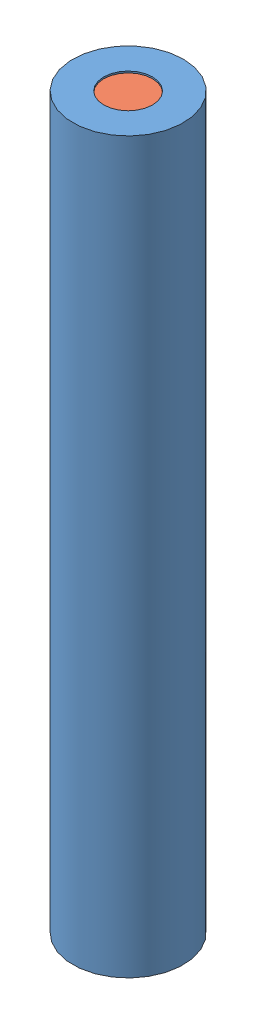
SolidWorks assembly 3B0076-2X.SLDASM, configuration Default (file format 9000). Lengths in mm.
Overall size (43.15 228.09 43.15).
3 component instances, 2 part files, 4 mates.
Components (placement in the parent):
- 3b0076-2XShrinkSkin-1: 3b0076-2XShrinkSkin.SLDPRT [Default] at origin size (34.54 228.09 34.54)
- ElectroChem3B0036-1: ElectroChem3B0036.SLDPRT [Default] at (0 0.508 0) size (33.5 111.4 33.5)
- ElectroChem3B0036-2: ElectroChem3B0036.SLDPRT [Default] at (0 116.184 0) x (0.35228 0 0.935895) z (-0.935895 0 0.35228) size (33.5 111.4 33.5)
Mates (geometry in assembly coordinates):
- Concentric1: concentric aligned: cylinder of 3b0076-2XShrinkSkin-1 through (0 0 0) axis (0 -1 0) radius 17.272; cylinder of ElectroChem3B0036-1 through (0 0.508 0) axis (0 -1 0) radius 16.75
- Concentric2: concentric aligned: cylinder of 3b0076-2XShrinkSkin-1 through (0 0 0) axis (0 -1 0) radius 17.272; cylinder of ElectroChem3B0036-2 through (0 116.184 0) axis (0 -1 0) radius 16.75
- Coincident1: coincident anti-aligned: plane of 3b0076-2XShrinkSkin-1 through (-16.764 227.584 0) normal (0 -1 0); plane of ElectroChem3B0036-2 through (0 227.584 0) normal (0 1 0)
- Coincident2: coincident anti-aligned: plane of 3b0076-2XShrinkSkin-1 through (-7.62 0.508 0) normal (0 1 0); plane of ElectroChem3B0036-1 through (-16.75 0.508 0) normal (0 -1 0)
